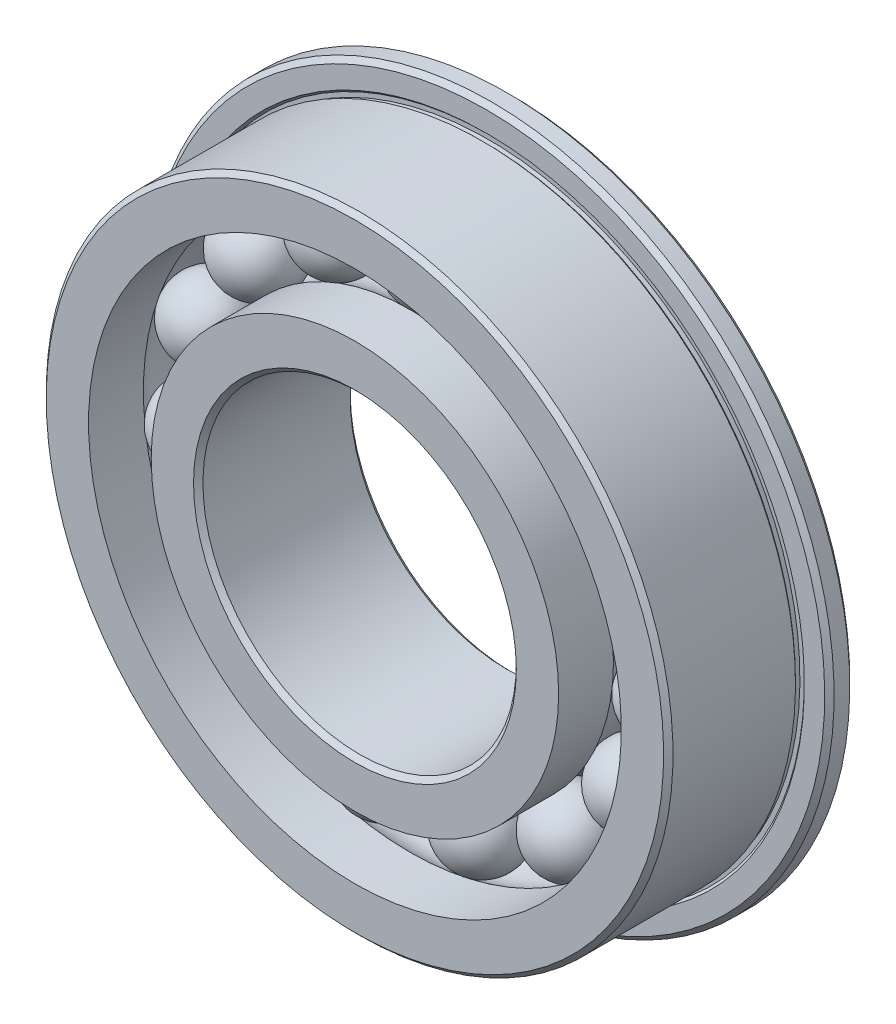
ISO-10303-21;
HEADER;
FILE_DESCRIPTION(('STEP AP214'),'2;1');
FILE_NAME('part.step','',(''),(''),'','','');
FILE_SCHEMA(('AUTOMOTIVE_DESIGN { 1 0 10303 214 1 1 1 1 }'));
ENDSEC;
DATA;
#1=APPLICATION_CONTEXT('core data for automotive mechanical design processes');
#2=APPLICATION_PROTOCOL_DEFINITION('international standard','automotive_design',2000,#1);
#3=PRODUCT_CONTEXT('',#1,'mechanical');
#4=PRODUCT('Part','Part','',(#3));
#5=PRODUCT_RELATED_PRODUCT_CATEGORY('part','',(#4));
#6=PRODUCT_DEFINITION_FORMATION('','',#4);
#7=PRODUCT_DEFINITION_CONTEXT('part definition',#1,'design');
#8=PRODUCT_DEFINITION('design','',#6,#7);
#9=PRODUCT_DEFINITION_SHAPE('','',#8);
#10=(LENGTH_UNIT() NAMED_UNIT(*) SI_UNIT(.MILLI.,.METRE.));
#11=(NAMED_UNIT(*) PLANE_ANGLE_UNIT() SI_UNIT($,.RADIAN.));
#12=(NAMED_UNIT(*) SI_UNIT($,.STERADIAN.) SOLID_ANGLE_UNIT());
#13=UNCERTAINTY_MEASURE_WITH_UNIT(LENGTH_MEASURE(1.E-05),#10,'distance_accuracy_value','');
#14=(GEOMETRIC_REPRESENTATION_CONTEXT(3) GLOBAL_UNCERTAINTY_ASSIGNED_CONTEXT((#13)) GLOBAL_UNIT_ASSIGNED_CONTEXT((#10,
#11,#12)) REPRESENTATION_CONTEXT('',''));
#15=CARTESIAN_POINT('',(0.,0.,0.));
#16=DIRECTION('',(0.,0.,1.));
#17=DIRECTION('',(1.,0.,0.));
#18=AXIS2_PLACEMENT_3D('',#15,#16,#17);
#19=CARTESIAN_POINT('',(-1.93708326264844,4.35076024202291,0.));
#20=DIRECTION('',(-0.406736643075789,0.913545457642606,0.));
#21=DIRECTION('',(0.913545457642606,0.406736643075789,0.));
#22=AXIS2_PLACEMENT_3D('',#19,#20,#21);
#23=SPHERICAL_SURFACE('',#22,0.79375);
#24=CARTESIAN_POINT('',(-2.25993047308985,5.07588694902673,0.));
#25=VERTEX_POINT('',#24);
#26=VERTEX_LOOP('',#25);
#27=FACE_BOUND('',#26,.T.);
#28=ADVANCED_FACE('F43',(#27),#23,.T.);
#29=CLOSED_SHELL('',(#28));
#30=MANIFOLD_SOLID_BREP('B2',#29);
#31=CARTESIAN_POINT('',(-3.53922723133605,3.1867345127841,0.));
#32=DIRECTION('',(-0.743144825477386,0.669130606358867,0.));
#33=DIRECTION('',(0.669130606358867,0.743144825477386,0.));
#34=AXIS2_PLACEMENT_3D('',#31,#32,#33);
#35=SPHERICAL_SURFACE('',#34,0.79375);
#36=CARTESIAN_POINT('',(-4.12909843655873,3.71785693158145,0.));
#37=VERTEX_POINT('',#36);
#38=VERTEX_LOOP('',#37);
#39=FACE_BOUND('',#38,.T.);
#40=ADVANCED_FACE('F61',(#39),#35,.T.);
#41=CLOSED_SHELL('',(#40));
#42=MANIFOLD_SOLID_BREP('B7',#41);
#43=CARTESIAN_POINT('',(-4.52940665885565,1.47169343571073,0.));
#44=DIRECTION('',(-0.95105651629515,0.309016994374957,0.));
#45=DIRECTION('',(0.309016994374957,0.95105651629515,0.));
#46=AXIS2_PLACEMENT_3D('',#43,#44,#45);
#47=SPHERICAL_SURFACE('',#46,0.79375);
#48=CARTESIAN_POINT('',(-5.28430776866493,1.71697567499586,0.));
#49=VERTEX_POINT('',#48);
#50=VERTEX_LOOP('',#49);
#51=FACE_BOUND('',#50,.T.);
#52=ADVANCED_FACE('F79',(#51),#47,.T.);
#53=CLOSED_SHELL('',(#52));
#54=MANIFOLD_SOLID_BREP('B39',#53);
#55=CARTESIAN_POINT('',(-4.73641052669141,-0.497816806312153,0.));
#56=DIRECTION('',(-0.994521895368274,-0.104528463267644,0.));
#57=DIRECTION('',(-0.104528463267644,0.994521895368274,0.));
#58=AXIS2_PLACEMENT_3D('',#55,#56,#57);
#59=SPHERICAL_SURFACE('',#58,0.79375);
#60=CARTESIAN_POINT('',(-5.52581228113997,-0.580786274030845,0.));
#61=VERTEX_POINT('',#60);
#62=VERTEX_LOOP('',#61);
#63=FACE_BOUND('',#62,.T.);
#64=ADVANCED_FACE('F97',(#63),#59,.T.);
#65=CLOSED_SHELL('',(#64));
#66=MANIFOLD_SOLID_BREP('B57',#65);
#67=CARTESIAN_POINT('',(-4.12444598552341,-2.38124999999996,0.));
#68=DIRECTION('',(-0.866025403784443,-0.499999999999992,0.));
#69=DIRECTION('',(-0.499999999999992,0.866025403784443,0.));
#70=AXIS2_PLACEMENT_3D('',#67,#68,#69);
#71=SPHERICAL_SURFACE('',#70,0.79375);
#72=CARTESIAN_POINT('',(-4.81185364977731,-2.77812499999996,0.));
#73=VERTEX_POINT('',#72);
#74=VERTEX_LOOP('',#73);
#75=FACE_BOUND('',#74,.T.);
#76=ADVANCED_FACE('F115',(#75),#71,.T.);
#77=CLOSED_SHELL('',(#76));
#78=MANIFOLD_SOLID_BREP('B75',#77);
#79=CARTESIAN_POINT('',(-2.79932726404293,-3.85294343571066,0.));
#80=DIRECTION('',(-0.58778525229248,-0.809016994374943,0.));
#81=DIRECTION('',(-0.809016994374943,0.58778525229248,0.));
#82=AXIS2_PLACEMENT_3D('',#79,#80,#81);
#83=SPHERICAL_SURFACE('',#82,0.79375);
#84=CARTESIAN_POINT('',(-3.26588180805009,-4.49510067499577,0.));
#85=VERTEX_POINT('',#84);
#86=VERTEX_LOOP('',#85);
#87=FACE_BOUND('',#86,.T.);
#88=ADVANCED_FACE('F133',(#87),#83,.T.);
#89=CLOSED_SHELL('',(#88));
#90=MANIFOLD_SOLID_BREP('B93',#89);
#91=CARTESIAN_POINT('',(-0.990179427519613,-4.65842794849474,0.));
#92=DIRECTION('',(-0.207911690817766,-0.978147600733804,0.));
#93=DIRECTION('',(-0.978147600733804,0.207911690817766,0.));
#94=AXIS2_PLACEMENT_3D('',#91,#92,#93);
#95=SPHERICAL_SURFACE('',#94,0.79375);
#96=CARTESIAN_POINT('',(-1.15520933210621,-5.4348326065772,0.));
#97=VERTEX_POINT('',#96);
#98=VERTEX_LOOP('',#97);
#99=FACE_BOUND('',#98,.T.);
#100=ADVANCED_FACE('F151',(#99),#95,.T.);
#101=CLOSED_SHELL('',(#100));
#102=MANIFOLD_SOLID_BREP('B111',#101);
#103=CARTESIAN_POINT('',(0.99017942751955,-4.65842794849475,0.));
#104=DIRECTION('',(0.207911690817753,-0.978147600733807,0.));
#105=DIRECTION('',(-0.978147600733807,-0.207911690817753,0.));
#106=AXIS2_PLACEMENT_3D('',#103,#104,#105);
#107=SPHERICAL_SURFACE('',#106,0.79375);
#108=CARTESIAN_POINT('',(1.15520933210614,-5.43483260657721,0.));
#109=VERTEX_POINT('',#108);
#110=VERTEX_LOOP('',#109);
#111=FACE_BOUND('',#110,.T.);
#112=ADVANCED_FACE('F169',(#111),#107,.T.);
#113=CLOSED_SHELL('',(#112));
#114=MANIFOLD_SOLID_BREP('B129',#113);
#115=CARTESIAN_POINT('',(2.79932726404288,-3.8529434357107,0.));
#116=DIRECTION('',(0.587785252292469,-0.80901699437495,0.));
#117=DIRECTION('',(-0.80901699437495,-0.587785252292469,0.));
#118=AXIS2_PLACEMENT_3D('',#115,#116,#117);
#119=SPHERICAL_SURFACE('',#118,0.79375);
#120=CARTESIAN_POINT('',(3.26588180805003,-4.49510067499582,0.));
#121=VERTEX_POINT('',#120);
#122=VERTEX_LOOP('',#121);
#123=FACE_BOUND('',#122,.T.);
#124=ADVANCED_FACE('F187',(#123),#119,.T.);
#125=CLOSED_SHELL('',(#124));
#126=MANIFOLD_SOLID_BREP('B147',#125);
#127=CARTESIAN_POINT('',(4.12444598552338,-2.38125000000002,0.));
#128=DIRECTION('',(0.866025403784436,-0.500000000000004,0.));
#129=DIRECTION('',(-0.500000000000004,-0.866025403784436,0.));
#130=AXIS2_PLACEMENT_3D('',#127,#128,#129);
#131=SPHERICAL_SURFACE('',#130,0.79375);
#132=CARTESIAN_POINT('',(4.81185364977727,-2.77812500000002,0.));
#133=VERTEX_POINT('',#132);
#134=VERTEX_LOOP('',#133);
#135=FACE_BOUND('',#134,.T.);
#136=ADVANCED_FACE('F205',(#135),#131,.T.);
#137=CLOSED_SHELL('',(#136));
#138=MANIFOLD_SOLID_BREP('B165',#137);
#139=CARTESIAN_POINT('',(4.7364105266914,-0.497816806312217,0.));
#140=DIRECTION('',(0.994521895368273,-0.104528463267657,0.));
#141=DIRECTION('',(-0.104528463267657,-0.994521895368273,0.));
#142=AXIS2_PLACEMENT_3D('',#139,#140,#141);
#143=SPHERICAL_SURFACE('',#142,0.79375);
#144=CARTESIAN_POINT('',(5.52581228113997,-0.58078627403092,0.));
#145=VERTEX_POINT('',#144);
#146=VERTEX_LOOP('',#145);
#147=FACE_BOUND('',#146,.T.);
#148=ADVANCED_FACE('F223',(#147),#143,.T.);
#149=CLOSED_SHELL('',(#148));
#150=MANIFOLD_SOLID_BREP('B183',#149);
#151=CARTESIAN_POINT('',(4.52940665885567,1.47169343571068,0.));
#152=DIRECTION('',(0.951056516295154,0.309016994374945,0.));
#153=DIRECTION('',(0.309016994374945,-0.951056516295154,0.));
#154=AXIS2_PLACEMENT_3D('',#151,#152,#153);
#155=SPHERICAL_SURFACE('',#154,0.79375);
#156=CARTESIAN_POINT('',(5.28430776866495,1.71697567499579,0.));
#157=VERTEX_POINT('',#156);
#158=VERTEX_LOOP('',#157);
#159=FACE_BOUND('',#158,.T.);
#160=ADVANCED_FACE('F241',(#159),#155,.T.);
#161=CLOSED_SHELL('',(#160));
#162=MANIFOLD_SOLID_BREP('B201',#161);
#163=CARTESIAN_POINT('',(3.5392272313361,3.18673451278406,0.));
#164=DIRECTION('',(0.743144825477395,0.669130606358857,0.));
#165=DIRECTION('',(0.669130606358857,-0.743144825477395,0.));
#166=AXIS2_PLACEMENT_3D('',#163,#164,#165);
#167=SPHERICAL_SURFACE('',#166,0.79375);
#168=CARTESIAN_POINT('',(4.12909843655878,3.7178569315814,0.));
#169=VERTEX_POINT('',#168);
#170=VERTEX_LOOP('',#169);
#171=FACE_BOUND('',#170,.T.);
#172=ADVANCED_FACE('F259',(#171),#167,.T.);
#173=CLOSED_SHELL('',(#172));
#174=MANIFOLD_SOLID_BREP('B219',#173);
#175=CARTESIAN_POINT('',(1.9370832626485,4.35076024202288,0.));
#176=DIRECTION('',(0.406736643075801,0.913545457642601,0.));
#177=DIRECTION('',(0.913545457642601,-0.406736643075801,0.));
#178=AXIS2_PLACEMENT_3D('',#175,#176,#177);
#179=SPHERICAL_SURFACE('',#178,0.79375);
#180=CARTESIAN_POINT('',(2.25993047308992,5.0758869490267,0.));
#181=VERTEX_POINT('',#180);
#182=VERTEX_LOOP('',#181);
#183=FACE_BOUND('',#182,.T.);
#184=ADVANCED_FACE('F277',(#183),#179,.T.);
#185=CLOSED_SHELL('',(#184));
#186=MANIFOLD_SOLID_BREP('B237',#185);
#187=CARTESIAN_POINT('',(0.,4.7625,0.));
#188=DIRECTION('',(0.,1.,0.));
#189=DIRECTION('',(1.,0.,0.));
#190=AXIS2_PLACEMENT_3D('',#187,#188,#189);
#191=SPHERICAL_SURFACE('',#190,0.79375);
#192=CARTESIAN_POINT('',(0.,5.55625,0.));
#193=VERTEX_POINT('',#192);
#194=VERTEX_LOOP('',#193);
#195=FACE_BOUND('',#194,.T.);
#196=ADVANCED_FACE('F298',(#195),#191,.T.);
#197=CLOSED_SHELL('',(#196));
#198=MANIFOLD_SOLID_BREP('B255',#197);
#199=CARTESIAN_POINT('',(0.,0.,0.));
#200=DIRECTION('',(0.,0.,1.));
#201=DIRECTION('',(0.,-1.,0.));
#202=AXIS2_PLACEMENT_3D('',#199,#200,#201);
#203=CYLINDRICAL_SURFACE('',#202,4.1275);
#204=CARTESIAN_POINT('',(0.,0.,-0.47625));
#205=DIRECTION('',(0.,0.,1.));
#206=DIRECTION('',(0.,-1.,0.));
#207=AXIS2_PLACEMENT_3D('',#204,#205,#206);
#208=CIRCLE('',#207,4.1275);
#209=CARTESIAN_POINT('',(0.,-4.1275,-0.47625));
#210=VERTEX_POINT('',#209);
#211=EDGE_CURVE('E339',#210,#210,#208,.T.);
#212=ORIENTED_EDGE('',*,*,#211,.F.);
#213=EDGE_LOOP('',(#212));
#214=FACE_BOUND('',#213,.T.);
#215=CARTESIAN_POINT('',(0.,0.,-1.5875));
#216=DIRECTION('',(0.,0.,1.));
#217=DIRECTION('',(0.,-1.,0.));
#218=AXIS2_PLACEMENT_3D('',#215,#216,#217);
#219=CIRCLE('',#218,4.1275);
#220=CARTESIAN_POINT('',(0.,-4.1275,-1.5875));
#221=VERTEX_POINT('',#220);
#222=EDGE_CURVE('E348',#221,#221,#219,.T.);
#223=ORIENTED_EDGE('',*,*,#222,.T.);
#224=EDGE_LOOP('',(#223));
#225=FACE_BOUND('',#224,.T.);
#226=ADVANCED_FACE('F319',(#214,#225),#203,.T.);
#227=CARTESIAN_POINT('',(0.,0.,0.));
#228=DIRECTION('',(0.,0.,1.));
#229=DIRECTION('',(0.,-1.,0.));
#230=AXIS2_PLACEMENT_3D('',#227,#228,#229);
#231=TOROIDAL_SURFACE('',#230,4.7625,0.79375);
#232=CARTESIAN_POINT('',(0.,0.,0.47625));
#233=DIRECTION('',(0.,0.,1.));
#234=DIRECTION('',(0.,-1.,0.));
#235=AXIS2_PLACEMENT_3D('',#232,#233,#234);
#236=CIRCLE('',#235,4.1275);
#237=CARTESIAN_POINT('',(0.,-4.1275,0.476249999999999));
#238=VERTEX_POINT('',#237);
#239=EDGE_CURVE('E342',#238,#238,#236,.T.);
#240=ORIENTED_EDGE('',*,*,#239,.F.);
#241=EDGE_LOOP('',(#240));
#242=FACE_BOUND('',#241,.T.);
#243=ORIENTED_EDGE('',*,*,#211,.T.);
#244=EDGE_LOOP('',(#243));
#245=FACE_BOUND('',#244,.T.);
#246=ADVANCED_FACE('F367',(#242,#245),#231,.F.);
#247=CARTESIAN_POINT('',(0.,0.,0.));
#248=DIRECTION('',(0.,0.,1.));
#249=DIRECTION('',(0.,-1.,0.));
#250=AXIS2_PLACEMENT_3D('',#247,#248,#249);
#251=CYLINDRICAL_SURFACE('',#250,4.1275);
#252=CARTESIAN_POINT('',(0.,0.,1.5875));
#253=DIRECTION('',(0.,0.,1.));
#254=DIRECTION('',(0.,-1.,0.));
#255=AXIS2_PLACEMENT_3D('',#252,#253,#254);
#256=CIRCLE('',#255,4.1275);
#257=CARTESIAN_POINT('',(0.,-4.1275,1.5875));
#258=VERTEX_POINT('',#257);
#259=EDGE_CURVE('E345',#258,#258,#256,.T.);
#260=ORIENTED_EDGE('',*,*,#259,.F.);
#261=EDGE_LOOP('',(#260));
#262=FACE_BOUND('',#261,.T.);
#263=ORIENTED_EDGE('',*,*,#239,.T.);
#264=EDGE_LOOP('',(#263));
#265=FACE_BOUND('',#264,.T.);
#266=ADVANCED_FACE('F373',(#262,#265),#251,.T.);
#267=CARTESIAN_POINT('',(0.,3.175,1.5875));
#268=DIRECTION('',(0.,0.,-1.));
#269=DIRECTION('',(0.,1.,0.));
#270=AXIS2_PLACEMENT_3D('',#267,#268,#269);
#271=PLANE('',#270);
#272=CARTESIAN_POINT('',(0.,0.,1.5875));
#273=DIRECTION('',(0.,0.,-1.));
#274=DIRECTION('',(0.,1.,0.));
#275=AXIS2_PLACEMENT_3D('',#272,#273,#274);
#276=CIRCLE('',#275,3.27025);
#277=CARTESIAN_POINT('',(0.,-3.27025,1.5875));
#278=VERTEX_POINT('',#277);
#279=EDGE_CURVE('E297',#278,#278,#276,.T.);
#280=ORIENTED_EDGE('',*,*,#279,.T.);
#281=EDGE_LOOP('',(#280));
#282=FACE_BOUND('',#281,.T.);
#283=ORIENTED_EDGE('',*,*,#259,.T.);
#284=EDGE_LOOP('',(#283));
#285=FACE_BOUND('',#284,.T.);
#286=ADVANCED_FACE('F364',(#282,#285),#271,.F.);
#287=CARTESIAN_POINT('',(0.,0.,0.));
#288=DIRECTION('',(0.,0.,1.));
#289=DIRECTION('',(0.,-1.,0.));
#290=AXIS2_PLACEMENT_3D('',#287,#288,#289);
#291=CYLINDRICAL_SURFACE('',#290,3.175);
#292=CARTESIAN_POINT('',(0.,0.,-1.49225));
#293=DIRECTION('',(0.,0.,1.));
#294=DIRECTION('',(0.,-1.,0.));
#295=AXIS2_PLACEMENT_3D('',#292,#293,#294);
#296=CIRCLE('',#295,3.175);
#297=CARTESIAN_POINT('',(0.,-3.175,-1.49225));
#298=VERTEX_POINT('',#297);
#299=EDGE_CURVE('E326',#298,#298,#296,.F.);
#300=CARTESIAN_POINT('',(0.,0.,1.49225));
#301=DIRECTION('',(0.,0.,-1.));
#302=DIRECTION('',(0.,1.,0.));
#303=AXIS2_PLACEMENT_3D('',#300,#301,#302);
#304=CIRCLE('',#303,3.175);
#305=CARTESIAN_POINT('',(0.,-3.175,1.49225));
#306=VERTEX_POINT('',#305);
#307=EDGE_CURVE('E330',#306,#306,#304,.F.);
#308=CARTESIAN_POINT('',(0.,-3.175,-1.49225));
#309=CARTESIAN_POINT('',(0.,-3.175,-1.46116145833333));
#310=CARTESIAN_POINT('',(0.,-3.175,-1.43007291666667));
#311=CARTESIAN_POINT('',(0.,-3.175,-1.36789583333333));
#312=CARTESIAN_POINT('',(0.,-3.175,-1.33680729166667));
#313=CARTESIAN_POINT('',(0.,-3.175,-1.27463020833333));
#314=CARTESIAN_POINT('',(0.,-3.175,-1.24354166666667));
#315=CARTESIAN_POINT('',(0.,-3.175,-1.18136458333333));
#316=CARTESIAN_POINT('',(0.,-3.175,-1.15027604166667));
#317=CARTESIAN_POINT('',(0.,-3.175,-1.08809895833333));
#318=CARTESIAN_POINT('',(0.,-3.175,-1.05701041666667));
#319=CARTESIAN_POINT('',(0.,-3.175,-0.994833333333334));
#320=CARTESIAN_POINT('',(0.,-3.175,-0.963744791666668));
#321=CARTESIAN_POINT('',(0.,-3.175,-0.901567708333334));
#322=CARTESIAN_POINT('',(0.,-3.175,-0.870479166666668));
#323=CARTESIAN_POINT('',(0.,-3.175,-0.808302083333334));
#324=CARTESIAN_POINT('',(0.,-3.175,-0.777213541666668));
#325=CARTESIAN_POINT('',(0.,-3.175,-0.715036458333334));
#326=CARTESIAN_POINT('',(0.,-3.175,-0.683947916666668));
#327=CARTESIAN_POINT('',(0.,-3.175,-0.621770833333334));
#328=CARTESIAN_POINT('',(0.,-3.175,-0.590682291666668));
#329=CARTESIAN_POINT('',(0.,-3.175,-0.528505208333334));
#330=CARTESIAN_POINT('',(0.,-3.175,-0.497416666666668));
#331=CARTESIAN_POINT('',(0.,-3.175,-0.435239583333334));
#332=CARTESIAN_POINT('',(0.,-3.175,-0.404151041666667));
#333=CARTESIAN_POINT('',(0.,-3.175,-0.341973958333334));
#334=CARTESIAN_POINT('',(0.,-3.175,-0.310885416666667));
#335=CARTESIAN_POINT('',(0.,-3.175,-0.248708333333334));
#336=CARTESIAN_POINT('',(0.,-3.175,-0.217619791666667));
#337=CARTESIAN_POINT('',(0.,-3.175,-0.155442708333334));
#338=CARTESIAN_POINT('',(0.,-3.175,-0.124354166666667));
#339=CARTESIAN_POINT('',(0.,-3.175,-0.062177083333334));
#340=CARTESIAN_POINT('',(0.,-3.175,-0.0310885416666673));
#341=CARTESIAN_POINT('',(0.,-3.175,0.0310885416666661));
#342=CARTESIAN_POINT('',(0.,-3.175,0.0621770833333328));
#343=CARTESIAN_POINT('',(0.,-3.175,0.124354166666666));
#344=CARTESIAN_POINT('',(0.,-3.175,0.155442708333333));
#345=CARTESIAN_POINT('',(0.,-3.175,0.217619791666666));
#346=CARTESIAN_POINT('',(0.,-3.175,0.248708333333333));
#347=CARTESIAN_POINT('',(0.,-3.175,0.310885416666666));
#348=CARTESIAN_POINT('',(0.,-3.175,0.341973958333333));
#349=CARTESIAN_POINT('',(0.,-3.175,0.404151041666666));
#350=CARTESIAN_POINT('',(0.,-3.175,0.435239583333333));
#351=CARTESIAN_POINT('',(0.,-3.175,0.497416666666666));
#352=CARTESIAN_POINT('',(0.,-3.175,0.528505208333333));
#353=CARTESIAN_POINT('',(0.,-3.175,0.590682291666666));
#354=CARTESIAN_POINT('',(0.,-3.175,0.621770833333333));
#355=CARTESIAN_POINT('',(0.,-3.175,0.683947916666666));
#356=CARTESIAN_POINT('',(0.,-3.175,0.715036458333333));
#357=CARTESIAN_POINT('',(0.,-3.175,0.777213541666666));
#358=CARTESIAN_POINT('',(0.,-3.175,0.808302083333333));
#359=CARTESIAN_POINT('',(0.,-3.175,0.870479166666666));
#360=CARTESIAN_POINT('',(0.,-3.175,0.901567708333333));
#361=CARTESIAN_POINT('',(0.,-3.175,0.963744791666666));
#362=CARTESIAN_POINT('',(0.,-3.175,0.994833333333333));
#363=CARTESIAN_POINT('',(0.,-3.175,1.05701041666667));
#364=CARTESIAN_POINT('',(0.,-3.175,1.08809895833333));
#365=CARTESIAN_POINT('',(0.,-3.175,1.15027604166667));
#366=CARTESIAN_POINT('',(0.,-3.175,1.18136458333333));
#367=CARTESIAN_POINT('',(0.,-3.175,1.24354166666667));
#368=CARTESIAN_POINT('',(0.,-3.175,1.27463020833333));
#369=CARTESIAN_POINT('',(0.,-3.175,1.33680729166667));
#370=CARTESIAN_POINT('',(0.,-3.175,1.36789583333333));
#371=CARTESIAN_POINT('',(0.,-3.175,1.43007291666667));
#372=CARTESIAN_POINT('',(0.,-3.175,1.46116145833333));
#373=CARTESIAN_POINT('',(0.,-3.175,1.49225));
#374=B_SPLINE_CURVE_WITH_KNOTS('',3,(#308,#309,#310,#311,#312,#313,#314,#315,#316,#317,#318,
#319,#320,#321,#322,#323,#324,#325,#326,#327,#328,#329,#330,#331,#332,#333,#334,#335,#336,#337,
#338,#339,#340,#341,#342,#343,#344,#345,#346,#347,#348,#349,#350,#351,#352,#353,#354,#355,#356,
#357,#358,#359,#360,#361,#362,#363,#364,#365,#366,#367,#368,#369,#370,#371,#372,#373),
.UNSPECIFIED.,.F.,.F.,(4,2,2,2,2,2,2,2,2,2,2,2,2,2,2,2,2,2,2,2,2,2,2,2,2,2,2,2,2,2,2,2,4),(0.,
0.093265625,0.18653125,0.279796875,0.3730625,0.466328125,0.55959375,0.652859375,0.746125,
0.839390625,0.93265625,1.025921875,1.1191875,1.212453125,1.30571875,1.398984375,1.49225,
1.585515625,1.67878125,1.772046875,1.8653125,1.958578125,2.05184375,2.145109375,2.238375,
2.331640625,2.42490625,2.518171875,2.6114375,2.704703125,2.79796875,2.891234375,2.9845),.UNSPECIFIED.);
#375=EDGE_CURVE('BSEAM356',#298,#306,#374,.T.);
#376=ORIENTED_EDGE('',*,*,#299,.T.);
#377=ORIENTED_EDGE('',*,*,#307,.T.);
#378=ORIENTED_EDGE('',*,*,#375,.T.);
#379=ORIENTED_EDGE('',*,*,#375,.F.);
#380=EDGE_LOOP('',(#376,#378,#377,#379));
#381=FACE_BOUND('',#380,.T.);
#382=ADVANCED_FACE('F356',(#381),#291,.F.);
#383=CARTESIAN_POINT('',(0.,4.1275,-1.5875));
#384=DIRECTION('',(0.,0.,1.));
#385=DIRECTION('',(0.,-1.,0.));
#386=AXIS2_PLACEMENT_3D('',#383,#384,#385);
#387=PLANE('',#386);
#388=CARTESIAN_POINT('',(0.,0.,-1.5875));
#389=DIRECTION('',(0.,0.,1.));
#390=DIRECTION('',(0.,-1.,0.));
#391=AXIS2_PLACEMENT_3D('',#388,#389,#390);
#392=CIRCLE('',#391,3.27025);
#393=CARTESIAN_POINT('',(0.,-3.27025,-1.5875));
#394=VERTEX_POINT('',#393);
#395=EDGE_CURVE('E334',#394,#394,#392,.T.);
#396=ORIENTED_EDGE('',*,*,#395,.T.);
#397=EDGE_LOOP('',(#396));
#398=FACE_BOUND('',#397,.T.);
#399=ORIENTED_EDGE('',*,*,#222,.F.);
#400=EDGE_LOOP('',(#399));
#401=FACE_BOUND('',#400,.T.);
#402=ADVANCED_FACE('F353',(#398,#401),#387,.F.);
#403=CARTESIAN_POINT('',(0.,0.,-1.5875));
#404=DIRECTION('',(0.,0.,-1.));
#405=DIRECTION('',(0.,1.,0.));
#406=AXIS2_PLACEMENT_3D('',#403,#404,#405);
#407=CONICAL_SURFACE('',#406,3.27025,0.785398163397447);
#408=ORIENTED_EDGE('',*,*,#299,.F.);
#409=EDGE_LOOP('',(#408));
#410=FACE_BOUND('',#409,.T.);
#411=ORIENTED_EDGE('',*,*,#395,.F.);
#412=EDGE_LOOP('',(#411));
#413=FACE_BOUND('',#412,.T.);
#414=ADVANCED_FACE('F355',(#410,#413),#407,.F.);
#415=CARTESIAN_POINT('',(0.,0.,1.49225));
#416=DIRECTION('',(0.,0.,1.));
#417=DIRECTION('',(0.,-1.,0.));
#418=AXIS2_PLACEMENT_3D('',#415,#416,#417);
#419=CONICAL_SURFACE('',#418,3.175,0.785398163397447);
#420=CARTESIAN_POINT('',(0.,-3.27025,1.5875));
#421=CARTESIAN_POINT('',(0.,-3.2692578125,1.5865078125));
#422=CARTESIAN_POINT('',(0.,-3.268265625,1.585515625));
#423=CARTESIAN_POINT('',(0.,-3.26628125,1.58353125));
#424=CARTESIAN_POINT('',(0.,-3.2652890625,1.5825390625));
#425=CARTESIAN_POINT('',(0.,-3.2633046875,1.5805546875));
#426=CARTESIAN_POINT('',(0.,-3.2623125,1.5795625));
#427=CARTESIAN_POINT('',(0.,-3.260328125,1.577578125));
#428=CARTESIAN_POINT('',(0.,-3.2593359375,1.5765859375));
#429=CARTESIAN_POINT('',(0.,-3.2573515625,1.5746015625));
#430=CARTESIAN_POINT('',(0.,-3.256359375,1.573609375));
#431=CARTESIAN_POINT('',(0.,-3.254375,1.571625));
#432=CARTESIAN_POINT('',(0.,-3.2533828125,1.5706328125));
#433=CARTESIAN_POINT('',(0.,-3.2513984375,1.5686484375));
#434=CARTESIAN_POINT('',(0.,-3.25040625,1.56765625));
#435=CARTESIAN_POINT('',(0.,-3.248421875,1.565671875));
#436=CARTESIAN_POINT('',(0.,-3.2474296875,1.5646796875));
#437=CARTESIAN_POINT('',(0.,-3.2454453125,1.5626953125));
#438=CARTESIAN_POINT('',(0.,-3.244453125,1.561703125));
#439=CARTESIAN_POINT('',(0.,-3.24246875,1.55971875));
#440=CARTESIAN_POINT('',(0.,-3.2414765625,1.5587265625));
#441=CARTESIAN_POINT('',(0.,-3.2394921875,1.5567421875));
#442=CARTESIAN_POINT('',(0.,-3.2385,1.55575));
#443=CARTESIAN_POINT('',(0.,-3.236515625,1.553765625));
#444=CARTESIAN_POINT('',(0.,-3.2355234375,1.5527734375));
#445=CARTESIAN_POINT('',(0.,-3.2335390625,1.5507890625));
#446=CARTESIAN_POINT('',(0.,-3.232546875,1.549796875));
#447=CARTESIAN_POINT('',(0.,-3.2305625,1.5478125));
#448=CARTESIAN_POINT('',(0.,-3.2295703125,1.5468203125));
#449=CARTESIAN_POINT('',(0.,-3.2275859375,1.5448359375));
#450=CARTESIAN_POINT('',(0.,-3.22659375,1.54384375));
#451=CARTESIAN_POINT('',(0.,-3.224609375,1.541859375));
#452=CARTESIAN_POINT('',(0.,-3.2236171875,1.5408671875));
#453=CARTESIAN_POINT('',(0.,-3.2216328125,1.5388828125));
#454=CARTESIAN_POINT('',(0.,-3.220640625,1.537890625));
#455=CARTESIAN_POINT('',(0.,-3.21865625,1.53590625));
#456=CARTESIAN_POINT('',(0.,-3.2176640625,1.5349140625));
#457=CARTESIAN_POINT('',(0.,-3.2156796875,1.5329296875));
#458=CARTESIAN_POINT('',(0.,-3.2146875,1.5319375));
#459=CARTESIAN_POINT('',(0.,-3.212703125,1.529953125));
#460=CARTESIAN_POINT('',(0.,-3.2117109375,1.5289609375));
#461=CARTESIAN_POINT('',(0.,-3.2097265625,1.5269765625));
#462=CARTESIAN_POINT('',(0.,-3.208734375,1.525984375));
#463=CARTESIAN_POINT('',(0.,-3.20675,1.524));
#464=CARTESIAN_POINT('',(0.,-3.2057578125,1.5230078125));
#465=CARTESIAN_POINT('',(0.,-3.2037734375,1.5210234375));
#466=CARTESIAN_POINT('',(0.,-3.20278125,1.52003125));
#467=CARTESIAN_POINT('',(0.,-3.200796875,1.518046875));
#468=CARTESIAN_POINT('',(0.,-3.1998046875,1.5170546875));
#469=CARTESIAN_POINT('',(0.,-3.1978203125,1.5150703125));
#470=CARTESIAN_POINT('',(0.,-3.196828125,1.514078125));
#471=CARTESIAN_POINT('',(0.,-3.19484375,1.51209375));
#472=CARTESIAN_POINT('',(0.,-3.1938515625,1.5111015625));
#473=CARTESIAN_POINT('',(0.,-3.1918671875,1.5091171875));
#474=CARTESIAN_POINT('',(0.,-3.190875,1.508125));
#475=CARTESIAN_POINT('',(0.,-3.188890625,1.506140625));
#476=CARTESIAN_POINT('',(0.,-3.1878984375,1.5051484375));
#477=CARTESIAN_POINT('',(0.,-3.1859140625,1.5031640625));
#478=CARTESIAN_POINT('',(0.,-3.184921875,1.502171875));
#479=CARTESIAN_POINT('',(0.,-3.1829375,1.5001875));
#480=CARTESIAN_POINT('',(0.,-3.1819453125,1.4991953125));
#481=CARTESIAN_POINT('',(0.,-3.1799609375,1.4972109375));
#482=CARTESIAN_POINT('',(0.,-3.17896875,1.49621875));
#483=CARTESIAN_POINT('',(0.,-3.176984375,1.494234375));
#484=CARTESIAN_POINT('',(0.,-3.1759921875,1.4932421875));
#485=CARTESIAN_POINT('',(0.,-3.175,1.49225));
#486=B_SPLINE_CURVE_WITH_KNOTS('',3,(#420,#421,#422,#423,#424,#425,#426,#427,#428,#429,#430,
#431,#432,#433,#434,#435,#436,#437,#438,#439,#440,#441,#442,#443,#444,#445,#446,#447,#448,#449,
#450,#451,#452,#453,#454,#455,#456,#457,#458,#459,#460,#461,#462,#463,#464,#465,#466,#467,#468,
#469,#470,#471,#472,#473,#474,#475,#476,#477,#478,#479,#480,#481,#482,#483,#484,#485),
.UNSPECIFIED.,.F.,.F.,(4,2,2,2,2,2,2,2,2,2,2,2,2,2,2,2,2,2,2,2,2,2,2,2,2,2,2,2,2,2,2,2,4),(0.,
0.00420949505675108,0.00841899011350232,0.0126284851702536,0.0168379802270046,
0.0210474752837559,0.0252569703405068,0.029466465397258,0.0336759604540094,0.0378854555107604,
0.0420949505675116,0.046304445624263,0.0505139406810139,0.0547234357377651,0.0589329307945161,
0.0631424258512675,0.0673519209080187,0.0715614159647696,0.075770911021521,0.0799804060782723,
0.0841899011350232,0.0883993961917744,0.0926088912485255,0.0968183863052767,0.101027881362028,
0.105237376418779,0.10944687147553,0.113656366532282,0.117865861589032,0.122075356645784,
0.126284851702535,0.130494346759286,0.134703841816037),.UNSPECIFIED.);
#487=EDGE_CURVE('BSEAM321',#278,#306,#486,.T.);
#488=ORIENTED_EDGE('',*,*,#279,.F.);
#489=ORIENTED_EDGE('',*,*,#307,.F.);
#490=ORIENTED_EDGE('',*,*,#487,.T.);
#491=ORIENTED_EDGE('',*,*,#487,.F.);
#492=EDGE_LOOP('',(#488,#490,#489,#491));
#493=FACE_BOUND('',#492,.T.);
#494=ADVANCED_FACE('F321',(#493),#419,.F.);
#495=CLOSED_SHELL('',(#226,#246,#266,#286,#382,#402,#414,#494));
#496=MANIFOLD_SOLID_BREP('B273',#495);
#497=CARTESIAN_POINT('',(0.,5.3975,-1.5875));
#498=DIRECTION('',(0.,0.,1.));
#499=DIRECTION('',(0.,-1.,0.));
#500=AXIS2_PLACEMENT_3D('',#497,#498,#499);
#501=PLANE('',#500);
#502=CARTESIAN_POINT('',(0.,0.,-1.5875));
#503=DIRECTION('',(0.,0.,1.));
#504=DIRECTION('',(0.,-1.,0.));
#505=AXIS2_PLACEMENT_3D('',#502,#503,#504);
#506=CIRCLE('',#505,6.85165);
#507=CARTESIAN_POINT('',(0.,-6.85165,-1.5875));
#508=VERTEX_POINT('',#507);
#509=EDGE_CURVE('E456',#508,#508,#506,.F.);
#510=ORIENTED_EDGE('',*,*,#509,.T.);
#511=EDGE_LOOP('',(#510));
#512=FACE_BOUND('',#511,.T.);
#513=CARTESIAN_POINT('',(0.,0.,-1.5875));
#514=DIRECTION('',(0.,0.,1.));
#515=DIRECTION('',(0.,-1.,0.));
#516=AXIS2_PLACEMENT_3D('',#513,#514,#515);
#517=CIRCLE('',#516,5.3975);
#518=CARTESIAN_POINT('',(0.,-5.3975,-1.5875));
#519=VERTEX_POINT('',#518);
#520=EDGE_CURVE('E467',#519,#519,#517,.T.);
#521=ORIENTED_EDGE('',*,*,#520,.T.);
#522=EDGE_LOOP('',(#521));
#523=FACE_BOUND('',#522,.T.);
#524=ADVANCED_FACE('F441',(#512,#523),#501,.F.);
#525=CARTESIAN_POINT('',(0.,0.,0.));
#526=DIRECTION('',(0.,0.,1.));
#527=DIRECTION('',(0.,-1.,0.));
#528=AXIS2_PLACEMENT_3D('',#525,#526,#527);
#529=CYLINDRICAL_SURFACE('',#528,5.3975);
#530=ORIENTED_EDGE('',*,*,#520,.F.);
#531=EDGE_LOOP('',(#530));
#532=FACE_BOUND('',#531,.T.);
#533=CARTESIAN_POINT('',(0.,0.,-0.47625));
#534=DIRECTION('',(0.,0.,1.));
#535=DIRECTION('',(0.,-1.,0.));
#536=AXIS2_PLACEMENT_3D('',#533,#534,#535);
#537=CIRCLE('',#536,5.3975);
#538=CARTESIAN_POINT('',(0.,-5.3975,-0.47625));
#539=VERTEX_POINT('',#538);
#540=EDGE_CURVE('E470',#539,#539,#537,.T.);
#541=ORIENTED_EDGE('',*,*,#540,.T.);
#542=EDGE_LOOP('',(#541));
#543=FACE_BOUND('',#542,.T.);
#544=ADVANCED_FACE('F513',(#532,#543),#529,.F.);
#545=CARTESIAN_POINT('',(0.,0.,0.));
#546=DIRECTION('',(0.,0.,1.));
#547=DIRECTION('',(0.,-1.,0.));
#548=AXIS2_PLACEMENT_3D('',#545,#546,#547);
#549=TOROIDAL_SURFACE('',#548,4.7625,0.79375);
#550=ORIENTED_EDGE('',*,*,#540,.F.);
#551=EDGE_LOOP('',(#550));
#552=FACE_BOUND('',#551,.T.);
#553=CARTESIAN_POINT('',(0.,0.,0.47625));
#554=DIRECTION('',(0.,0.,1.));
#555=DIRECTION('',(0.,-1.,0.));
#556=AXIS2_PLACEMENT_3D('',#553,#554,#555);
#557=CIRCLE('',#556,5.3975);
#558=CARTESIAN_POINT('',(0.,-5.3975,0.476249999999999));
#559=VERTEX_POINT('',#558);
#560=EDGE_CURVE('E473',#559,#559,#557,.T.);
#561=ORIENTED_EDGE('',*,*,#560,.T.);
#562=EDGE_LOOP('',(#561));
#563=FACE_BOUND('',#562,.T.);
#564=ADVANCED_FACE('F519',(#552,#563),#549,.F.);
#565=CARTESIAN_POINT('',(0.,0.,0.));
#566=DIRECTION('',(0.,0.,1.));
#567=DIRECTION('',(0.,-1.,0.));
#568=AXIS2_PLACEMENT_3D('',#565,#566,#567);
#569=CYLINDRICAL_SURFACE('',#568,5.3975);
#570=ORIENTED_EDGE('',*,*,#560,.F.);
#571=EDGE_LOOP('',(#570));
#572=FACE_BOUND('',#571,.T.);
#573=CARTESIAN_POINT('',(0.,0.,1.5875));
#574=DIRECTION('',(0.,0.,1.));
#575=DIRECTION('',(0.,-1.,0.));
#576=AXIS2_PLACEMENT_3D('',#573,#574,#575);
#577=CIRCLE('',#576,5.3975);
#578=CARTESIAN_POINT('',(0.,-5.3975,1.5875));
#579=VERTEX_POINT('',#578);
#580=EDGE_CURVE('E476',#579,#579,#577,.T.);
#581=ORIENTED_EDGE('',*,*,#580,.T.);
#582=EDGE_LOOP('',(#581));
#583=FACE_BOUND('',#582,.T.);
#584=ADVANCED_FACE('F583',(#572,#583),#569,.F.);
#585=CARTESIAN_POINT('',(0.,6.35,1.5875));
#586=DIRECTION('',(0.,0.,-1.));
#587=DIRECTION('',(0.,1.,0.));
#588=AXIS2_PLACEMENT_3D('',#585,#586,#587);
#589=PLANE('',#588);
#590=CARTESIAN_POINT('',(0.,0.,1.5875));
#591=DIRECTION('',(0.,0.,-1.));
#592=DIRECTION('',(0.,1.,0.));
#593=AXIS2_PLACEMENT_3D('',#590,#591,#592);
#594=CIRCLE('',#593,6.25475);
#595=CARTESIAN_POINT('',(0.,6.25475,1.5875));
#596=VERTEX_POINT('',#595);
#597=EDGE_CURVE('E448',#596,#596,#594,.F.);
#598=ORIENTED_EDGE('',*,*,#597,.T.);
#599=EDGE_LOOP('',(#598));
#600=FACE_BOUND('',#599,.T.);
#601=ORIENTED_EDGE('',*,*,#580,.F.);
#602=EDGE_LOOP('',(#601));
#603=FACE_BOUND('',#602,.T.);
#604=ADVANCED_FACE('F573',(#600,#603),#589,.F.);
#605=CARTESIAN_POINT('',(0.,0.,0.));
#606=DIRECTION('',(0.,0.,1.));
#607=DIRECTION('',(0.,-1.,0.));
#608=AXIS2_PLACEMENT_3D('',#605,#606,#607);
#609=CYLINDRICAL_SURFACE('',#608,6.35);
#610=CARTESIAN_POINT('',(0.,0.,1.49225));
#611=DIRECTION('',(0.,0.,-1.));
#612=DIRECTION('',(0.,1.,0.));
#613=AXIS2_PLACEMENT_3D('',#610,#611,#612);
#614=CIRCLE('',#613,6.35);
#615=CARTESIAN_POINT('',(0.,6.35,1.49225));
#616=VERTEX_POINT('',#615);
#617=EDGE_CURVE('E318',#616,#616,#614,.T.);
#618=ORIENTED_EDGE('',*,*,#617,.T.);
#619=EDGE_LOOP('',(#618));
#620=FACE_BOUND('',#619,.T.);
#621=CARTESIAN_POINT('',(0.,0.,-0.989697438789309));
#622=DIRECTION('',(0.,0.,1.));
#623=DIRECTION('',(0.,-1.,0.));
#624=AXIS2_PLACEMENT_3D('',#621,#622,#623);
#625=CIRCLE('',#624,6.35);
#626=CARTESIAN_POINT('',(0.,-6.35,-0.98969743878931));
#627=VERTEX_POINT('',#626);
#628=EDGE_CURVE('E479',#627,#627,#625,.T.);
#629=ORIENTED_EDGE('',*,*,#628,.T.);
#630=EDGE_LOOP('',(#629));
#631=FACE_BOUND('',#630,.T.);
#632=ADVANCED_FACE('F567',(#620,#631),#609,.T.);
#633=CARTESIAN_POINT('',(0.,0.,-1.03459871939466));
#634=DIRECTION('',(0.,0.,1.));
#635=DIRECTION('',(0.,-1.,0.));
#636=AXIS2_PLACEMENT_3D('',#633,#634,#635);
#637=CONICAL_SURFACE('',#636,6.30509871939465,0.785398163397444);
#638=ORIENTED_EDGE('',*,*,#628,.F.);
#639=EDGE_LOOP('',(#638));
#640=FACE_BOUND('',#639,.T.);
#641=CARTESIAN_POINT('',(0.,0.,-1.03459871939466));
#642=DIRECTION('',(0.,0.,1.));
#643=DIRECTION('',(0.,-1.,0.));
#644=AXIS2_PLACEMENT_3D('',#641,#642,#643);
#645=CIRCLE('',#644,6.30509871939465);
#646=CARTESIAN_POINT('',(0.,-6.30509871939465,-1.03459871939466));
#647=VERTEX_POINT('',#646);
#648=EDGE_CURVE('E482',#647,#647,#645,.T.);
#649=ORIENTED_EDGE('',*,*,#648,.T.);
#650=EDGE_LOOP('',(#649));
#651=FACE_BOUND('',#650,.T.);
#652=ADVANCED_FACE('F572',(#640,#651),#637,.T.);
#653=CARTESIAN_POINT('',(0.,0.,0.));
#654=DIRECTION('',(0.,0.,1.));
#655=DIRECTION('',(0.,-1.,0.));
#656=AXIS2_PLACEMENT_3D('',#653,#654,#655);
#657=CYLINDRICAL_SURFACE('',#656,6.30509871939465);
#658=ORIENTED_EDGE('',*,*,#648,.F.);
#659=EDGE_LOOP('',(#658));
#660=FACE_BOUND('',#659,.T.);
#661=CARTESIAN_POINT('',(0.,0.,-1.12440128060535));
#662=DIRECTION('',(0.,0.,1.));
#663=DIRECTION('',(0.,-1.,0.));
#664=AXIS2_PLACEMENT_3D('',#661,#662,#663);
#665=CIRCLE('',#664,6.30509871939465);
#666=CARTESIAN_POINT('',(0.,-6.30509871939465,-1.12440128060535));
#667=VERTEX_POINT('',#666);
#668=EDGE_CURVE('E485',#667,#667,#665,.T.);
#669=ORIENTED_EDGE('',*,*,#668,.T.);
#670=EDGE_LOOP('',(#669));
#671=FACE_BOUND('',#670,.T.);
#672=ADVANCED_FACE('F605',(#660,#671),#657,.T.);
#673=CARTESIAN_POINT('',(0.,6.39490128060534,-1.12440128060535));
#674=DIRECTION('',(0.,0.,-1.));
#675=DIRECTION('',(0.,1.,0.));
#676=AXIS2_PLACEMENT_3D('',#673,#674,#675);
#677=PLANE('',#676);
#678=ORIENTED_EDGE('',*,*,#668,.F.);
#679=EDGE_LOOP('',(#678));
#680=FACE_BOUND('',#679,.T.);
#681=CARTESIAN_POINT('',(0.,0.,-1.12440128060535));
#682=DIRECTION('',(0.,0.,1.));
#683=DIRECTION('',(0.,-1.,0.));
#684=AXIS2_PLACEMENT_3D('',#681,#682,#683);
#685=CIRCLE('',#684,6.39490128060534);
#686=CARTESIAN_POINT('',(0.,-6.39490128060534,-1.12440128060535));
#687=VERTEX_POINT('',#686);
#688=EDGE_CURVE('E488',#687,#687,#685,.T.);
#689=ORIENTED_EDGE('',*,*,#688,.T.);
#690=EDGE_LOOP('',(#689));
#691=FACE_BOUND('',#690,.T.);
#692=ADVANCED_FACE('F509',(#680,#691),#677,.F.);
#693=CARTESIAN_POINT('',(0.,0.,-1.0795));
#694=DIRECTION('',(0.,0.,1.));
#695=DIRECTION('',(0.,-1.,0.));
#696=AXIS2_PLACEMENT_3D('',#693,#694,#695);
#697=CONICAL_SURFACE('',#696,6.43980256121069,0.785398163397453);
#698=ORIENTED_EDGE('',*,*,#688,.F.);
#699=EDGE_LOOP('',(#698));
#700=FACE_BOUND('',#699,.T.);
#701=CARTESIAN_POINT('',(0.,0.,-1.0795));
#702=DIRECTION('',(0.,0.,1.));
#703=DIRECTION('',(0.,-1.,0.));
#704=AXIS2_PLACEMENT_3D('',#701,#702,#703);
#705=CIRCLE('',#704,6.43980256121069);
#706=CARTESIAN_POINT('',(0.,-6.43980256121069,-1.0795));
#707=VERTEX_POINT('',#706);
#708=EDGE_CURVE('E491',#707,#707,#705,.T.);
#709=ORIENTED_EDGE('',*,*,#708,.T.);
#710=EDGE_LOOP('',(#709));
#711=FACE_BOUND('',#710,.T.);
#712=ADVANCED_FACE('F495',(#700,#711),#697,.F.);
#713=CARTESIAN_POINT('',(0.,6.9469,-1.0795));
#714=DIRECTION('',(0.,0.,-1.));
#715=DIRECTION('',(0.,1.,0.));
#716=AXIS2_PLACEMENT_3D('',#713,#714,#715);
#717=PLANE('',#716);
#718=CARTESIAN_POINT('',(0.,0.,-1.0795));
#719=DIRECTION('',(0.,0.,-1.));
#720=DIRECTION('',(0.,1.,0.));
#721=AXIS2_PLACEMENT_3D('',#718,#719,#720);
#722=CIRCLE('',#721,6.85165);
#723=CARTESIAN_POINT('',(0.,6.85165,-1.0795));
#724=VERTEX_POINT('',#723);
#725=EDGE_CURVE('E452',#724,#724,#722,.F.);
#726=ORIENTED_EDGE('',*,*,#725,.T.);
#727=EDGE_LOOP('',(#726));
#728=FACE_BOUND('',#727,.T.);
#729=ORIENTED_EDGE('',*,*,#708,.F.);
#730=EDGE_LOOP('',(#729));
#731=FACE_BOUND('',#730,.T.);
#732=ADVANCED_FACE('F497',(#728,#731),#717,.F.);
#733=CARTESIAN_POINT('',(0.,0.,0.));
#734=DIRECTION('',(0.,0.,1.));
#735=DIRECTION('',(0.,-1.,0.));
#736=AXIS2_PLACEMENT_3D('',#733,#734,#735);
#737=CYLINDRICAL_SURFACE('',#736,6.9469);
#738=CARTESIAN_POINT('',(0.,0.,-1.49225));
#739=DIRECTION('',(0.,0.,1.));
#740=DIRECTION('',(0.,-1.,0.));
#741=AXIS2_PLACEMENT_3D('',#738,#739,#740);
#742=CIRCLE('',#741,6.9469);
#743=CARTESIAN_POINT('',(0.,-6.9469,-1.49225));
#744=VERTEX_POINT('',#743);
#745=EDGE_CURVE('E461',#744,#744,#742,.T.);
#746=CARTESIAN_POINT('',(0.,0.,-1.17475));
#747=DIRECTION('',(0.,0.,-1.));
#748=DIRECTION('',(0.,1.,0.));
#749=AXIS2_PLACEMENT_3D('',#746,#747,#748);
#750=CIRCLE('',#749,6.9469);
#751=CARTESIAN_POINT('',(0.,-6.9469,-1.17475));
#752=VERTEX_POINT('',#751);
#753=EDGE_CURVE('E464',#752,#752,#750,.T.);
#754=CARTESIAN_POINT('',(0.,-6.9469,-1.49225));
#755=CARTESIAN_POINT('',(0.,-6.9469,-1.48894270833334));
#756=CARTESIAN_POINT('',(0.,-6.9469,-1.48563541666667));
#757=CARTESIAN_POINT('',(0.,-6.9469,-1.47902083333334));
#758=CARTESIAN_POINT('',(0.,-6.9469,-1.47571354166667));
#759=CARTESIAN_POINT('',(0.,-6.9469,-1.46909895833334));
#760=CARTESIAN_POINT('',(0.,-6.9469,-1.46579166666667));
#761=CARTESIAN_POINT('',(0.,-6.9469,-1.45917708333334));
#762=CARTESIAN_POINT('',(0.,-6.9469,-1.45586979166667));
#763=CARTESIAN_POINT('',(0.,-6.9469,-1.44925520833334));
#764=CARTESIAN_POINT('',(0.,-6.9469,-1.44594791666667));
#765=CARTESIAN_POINT('',(0.,-6.9469,-1.43933333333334));
#766=CARTESIAN_POINT('',(0.,-6.9469,-1.43602604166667));
#767=CARTESIAN_POINT('',(0.,-6.9469,-1.42941145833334));
#768=CARTESIAN_POINT('',(0.,-6.9469,-1.42610416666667));
#769=CARTESIAN_POINT('',(0.,-6.9469,-1.41948958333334));
#770=CARTESIAN_POINT('',(0.,-6.9469,-1.41618229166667));
#771=CARTESIAN_POINT('',(0.,-6.9469,-1.40956770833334));
#772=CARTESIAN_POINT('',(0.,-6.9469,-1.40626041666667));
#773=CARTESIAN_POINT('',(0.,-6.9469,-1.39964583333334));
#774=CARTESIAN_POINT('',(0.,-6.9469,-1.39633854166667));
#775=CARTESIAN_POINT('',(0.,-6.9469,-1.38972395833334));
#776=CARTESIAN_POINT('',(0.,-6.9469,-1.38641666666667));
#777=CARTESIAN_POINT('',(0.,-6.9469,-1.37980208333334));
#778=CARTESIAN_POINT('',(0.,-6.9469,-1.37649479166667));
#779=CARTESIAN_POINT('',(0.,-6.9469,-1.36988020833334));
#780=CARTESIAN_POINT('',(0.,-6.9469,-1.36657291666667));
#781=CARTESIAN_POINT('',(0.,-6.9469,-1.35995833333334));
#782=CARTESIAN_POINT('',(0.,-6.9469,-1.35665104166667));
#783=CARTESIAN_POINT('',(0.,-6.9469,-1.35003645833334));
#784=CARTESIAN_POINT('',(0.,-6.9469,-1.34672916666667));
#785=CARTESIAN_POINT('',(0.,-6.9469,-1.34011458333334));
#786=CARTESIAN_POINT('',(0.,-6.9469,-1.33680729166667));
#787=CARTESIAN_POINT('',(0.,-6.9469,-1.33019270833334));
#788=CARTESIAN_POINT('',(0.,-6.9469,-1.32688541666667));
#789=CARTESIAN_POINT('',(0.,-6.9469,-1.32027083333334));
#790=CARTESIAN_POINT('',(0.,-6.9469,-1.31696354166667));
#791=CARTESIAN_POINT('',(0.,-6.9469,-1.31034895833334));
#792=CARTESIAN_POINT('',(0.,-6.9469,-1.30704166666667));
#793=CARTESIAN_POINT('',(0.,-6.9469,-1.30042708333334));
#794=CARTESIAN_POINT('',(0.,-6.9469,-1.29711979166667));
#795=CARTESIAN_POINT('',(0.,-6.9469,-1.29050520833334));
#796=CARTESIAN_POINT('',(0.,-6.9469,-1.28719791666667));
#797=CARTESIAN_POINT('',(0.,-6.9469,-1.28058333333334));
#798=CARTESIAN_POINT('',(0.,-6.9469,-1.27727604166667));
#799=CARTESIAN_POINT('',(0.,-6.9469,-1.27066145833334));
#800=CARTESIAN_POINT('',(0.,-6.9469,-1.26735416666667));
#801=CARTESIAN_POINT('',(0.,-6.9469,-1.26073958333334));
#802=CARTESIAN_POINT('',(0.,-6.9469,-1.25743229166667));
#803=CARTESIAN_POINT('',(0.,-6.9469,-1.25081770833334));
#804=CARTESIAN_POINT('',(0.,-6.9469,-1.24751041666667));
#805=CARTESIAN_POINT('',(0.,-6.9469,-1.24089583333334));
#806=CARTESIAN_POINT('',(0.,-6.9469,-1.23758854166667));
#807=CARTESIAN_POINT('',(0.,-6.9469,-1.23097395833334));
#808=CARTESIAN_POINT('',(0.,-6.9469,-1.22766666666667));
#809=CARTESIAN_POINT('',(0.,-6.9469,-1.22105208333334));
#810=CARTESIAN_POINT('',(0.,-6.9469,-1.21774479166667));
#811=CARTESIAN_POINT('',(0.,-6.9469,-1.21113020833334));
#812=CARTESIAN_POINT('',(0.,-6.9469,-1.20782291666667));
#813=CARTESIAN_POINT('',(0.,-6.9469,-1.20120833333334));
#814=CARTESIAN_POINT('',(0.,-6.9469,-1.19790104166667));
#815=CARTESIAN_POINT('',(0.,-6.9469,-1.19128645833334));
#816=CARTESIAN_POINT('',(0.,-6.9469,-1.18797916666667));
#817=CARTESIAN_POINT('',(0.,-6.9469,-1.18136458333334));
#818=CARTESIAN_POINT('',(0.,-6.9469,-1.17805729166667));
#819=CARTESIAN_POINT('',(0.,-6.9469,-1.17475));
#820=B_SPLINE_CURVE_WITH_KNOTS('',3,(#754,#755,#756,#757,#758,#759,#760,#761,#762,#763,#764,
#765,#766,#767,#768,#769,#770,#771,#772,#773,#774,#775,#776,#777,#778,#779,#780,#781,#782,#783,
#784,#785,#786,#787,#788,#789,#790,#791,#792,#793,#794,#795,#796,#797,#798,#799,#800,#801,#802,
#803,#804,#805,#806,#807,#808,#809,#810,#811,#812,#813,#814,#815,#816,#817,#818,#819),
.UNSPECIFIED.,.F.,.F.,(4,2,2,2,2,2,2,2,2,2,2,2,2,2,2,2,2,2,2,2,2,2,2,2,2,2,2,2,2,2,2,2,4),(0.,
0.00992187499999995,0.0198437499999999,0.0297656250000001,0.0396875,0.049609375,
0.0595312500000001,0.0694531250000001,0.079375,0.089296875,0.0992187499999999,0.109140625,
0.1190625,0.128984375,0.13890625,0.148828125,0.15875,0.168671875,0.17859375,0.188515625,
0.1984375,0.208359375,0.21828125,0.228203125,0.238125,0.248046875,0.25796875,0.267890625,
0.2778125,0.287734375,0.29765625,0.307578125,0.3175),.UNSPECIFIED.);
#821=EDGE_CURVE('BSEAM499',#744,#752,#820,.T.);
#822=ORIENTED_EDGE('',*,*,#745,.T.);
#823=ORIENTED_EDGE('',*,*,#753,.T.);
#824=ORIENTED_EDGE('',*,*,#821,.T.);
#825=ORIENTED_EDGE('',*,*,#821,.F.);
#826=EDGE_LOOP('',(#822,#824,#823,#825));
#827=FACE_BOUND('',#826,.T.);
#828=ADVANCED_FACE('F499',(#827),#737,.T.);
#829=CARTESIAN_POINT('',(0.,0.,-1.49225));
#830=DIRECTION('',(0.,0.,1.));
#831=DIRECTION('',(0.,-1.,0.));
#832=AXIS2_PLACEMENT_3D('',#829,#830,#831);
#833=CONICAL_SURFACE('',#832,6.9469,0.785398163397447);
#834=CARTESIAN_POINT('',(0.,-6.85165,-1.5875));
#835=CARTESIAN_POINT('',(0.,-6.8526421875,-1.5865078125));
#836=CARTESIAN_POINT('',(0.,-6.853634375,-1.585515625));
#837=CARTESIAN_POINT('',(0.,-6.85561875,-1.58353125));
#838=CARTESIAN_POINT('',(0.,-6.8566109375,-1.5825390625));
#839=CARTESIAN_POINT('',(0.,-6.8585953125,-1.5805546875));
#840=CARTESIAN_POINT('',(0.,-6.8595875,-1.5795625));
#841=CARTESIAN_POINT('',(0.,-6.861571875,-1.577578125));
#842=CARTESIAN_POINT('',(0.,-6.8625640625,-1.5765859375));
#843=CARTESIAN_POINT('',(0.,-6.8645484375,-1.5746015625));
#844=CARTESIAN_POINT('',(0.,-6.865540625,-1.573609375));
#845=CARTESIAN_POINT('',(0.,-6.867525,-1.571625));
#846=CARTESIAN_POINT('',(0.,-6.8685171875,-1.5706328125));
#847=CARTESIAN_POINT('',(0.,-6.8705015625,-1.5686484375));
#848=CARTESIAN_POINT('',(0.,-6.87149375,-1.56765625));
#849=CARTESIAN_POINT('',(0.,-6.873478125,-1.565671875));
#850=CARTESIAN_POINT('',(0.,-6.8744703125,-1.5646796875));
#851=CARTESIAN_POINT('',(0.,-6.8764546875,-1.5626953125));
#852=CARTESIAN_POINT('',(0.,-6.877446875,-1.561703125));
#853=CARTESIAN_POINT('',(0.,-6.87943125,-1.55971875));
#854=CARTESIAN_POINT('',(0.,-6.8804234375,-1.5587265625));
#855=CARTESIAN_POINT('',(0.,-6.8824078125,-1.5567421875));
#856=CARTESIAN_POINT('',(0.,-6.8834,-1.55575));
#857=CARTESIAN_POINT('',(0.,-6.885384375,-1.553765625));
#858=CARTESIAN_POINT('',(0.,-6.8863765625,-1.5527734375));
#859=CARTESIAN_POINT('',(0.,-6.8883609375,-1.5507890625));
#860=CARTESIAN_POINT('',(0.,-6.889353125,-1.549796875));
#861=CARTESIAN_POINT('',(0.,-6.8913375,-1.5478125));
#862=CARTESIAN_POINT('',(0.,-6.8923296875,-1.5468203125));
#863=CARTESIAN_POINT('',(0.,-6.8943140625,-1.5448359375));
#864=CARTESIAN_POINT('',(0.,-6.89530625,-1.54384375));
#865=CARTESIAN_POINT('',(0.,-6.897290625,-1.541859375));
#866=CARTESIAN_POINT('',(0.,-6.8982828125,-1.5408671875));
#867=CARTESIAN_POINT('',(0.,-6.9002671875,-1.5388828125));
#868=CARTESIAN_POINT('',(0.,-6.901259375,-1.537890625));
#869=CARTESIAN_POINT('',(0.,-6.90324375,-1.53590625));
#870=CARTESIAN_POINT('',(0.,-6.9042359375,-1.5349140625));
#871=CARTESIAN_POINT('',(0.,-6.9062203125,-1.5329296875));
#872=CARTESIAN_POINT('',(0.,-6.9072125,-1.5319375));
#873=CARTESIAN_POINT('',(0.,-6.909196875,-1.529953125));
#874=CARTESIAN_POINT('',(0.,-6.9101890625,-1.5289609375));
#875=CARTESIAN_POINT('',(0.,-6.9121734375,-1.5269765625));
#876=CARTESIAN_POINT('',(0.,-6.913165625,-1.525984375));
#877=CARTESIAN_POINT('',(0.,-6.91515,-1.524));
#878=CARTESIAN_POINT('',(0.,-6.9161421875,-1.5230078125));
#879=CARTESIAN_POINT('',(0.,-6.9181265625,-1.5210234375));
#880=CARTESIAN_POINT('',(0.,-6.91911875,-1.52003125));
#881=CARTESIAN_POINT('',(0.,-6.921103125,-1.518046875));
#882=CARTESIAN_POINT('',(0.,-6.9220953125,-1.5170546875));
#883=CARTESIAN_POINT('',(0.,-6.9240796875,-1.5150703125));
#884=CARTESIAN_POINT('',(0.,-6.925071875,-1.514078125));
#885=CARTESIAN_POINT('',(0.,-6.92705625,-1.51209375));
#886=CARTESIAN_POINT('',(0.,-6.9280484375,-1.5111015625));
#887=CARTESIAN_POINT('',(0.,-6.9300328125,-1.5091171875));
#888=CARTESIAN_POINT('',(0.,-6.931025,-1.508125));
#889=CARTESIAN_POINT('',(0.,-6.933009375,-1.506140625));
#890=CARTESIAN_POINT('',(0.,-6.9340015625,-1.5051484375));
#891=CARTESIAN_POINT('',(0.,-6.9359859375,-1.5031640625));
#892=CARTESIAN_POINT('',(0.,-6.936978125,-1.502171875));
#893=CARTESIAN_POINT('',(0.,-6.9389625,-1.5001875));
#894=CARTESIAN_POINT('',(0.,-6.9399546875,-1.4991953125));
#895=CARTESIAN_POINT('',(0.,-6.9419390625,-1.4972109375));
#896=CARTESIAN_POINT('',(0.,-6.94293125,-1.49621875));
#897=CARTESIAN_POINT('',(0.,-6.944915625,-1.494234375));
#898=CARTESIAN_POINT('',(0.,-6.9459078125,-1.4932421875));
#899=CARTESIAN_POINT('',(0.,-6.9469,-1.49225));
#900=B_SPLINE_CURVE_WITH_KNOTS('',3,(#834,#835,#836,#837,#838,#839,#840,#841,#842,#843,#844,
#845,#846,#847,#848,#849,#850,#851,#852,#853,#854,#855,#856,#857,#858,#859,#860,#861,#862,#863,
#864,#865,#866,#867,#868,#869,#870,#871,#872,#873,#874,#875,#876,#877,#878,#879,#880,#881,#882,
#883,#884,#885,#886,#887,#888,#889,#890,#891,#892,#893,#894,#895,#896,#897,#898,#899),
.UNSPECIFIED.,.F.,.F.,(4,2,2,2,2,2,2,2,2,2,2,2,2,2,2,2,2,2,2,2,2,2,2,2,2,2,2,2,2,2,2,2,4),(0.,
0.00420949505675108,0.00841899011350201,0.0126284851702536,0.0168379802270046,
0.0210474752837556,0.0252569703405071,0.029466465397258,0.0336759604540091,0.0378854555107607,
0.0420949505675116,0.0463044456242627,0.0505139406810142,0.0547234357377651,0.0589329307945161,
0.0631424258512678,0.0673519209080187,0.0715614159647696,0.0757709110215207,0.0799804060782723,
0.0841899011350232,0.0883993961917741,0.0926088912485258,0.0968183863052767,0.101027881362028,
0.105237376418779,0.10944687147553,0.113656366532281,0.117865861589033,0.122075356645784,
0.126284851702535,0.130494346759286,0.134703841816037),.UNSPECIFIED.);
#901=EDGE_CURVE('BSEAM506',#508,#744,#900,.T.);
#902=ORIENTED_EDGE('',*,*,#509,.F.);
#903=ORIENTED_EDGE('',*,*,#745,.F.);
#904=ORIENTED_EDGE('',*,*,#901,.T.);
#905=ORIENTED_EDGE('',*,*,#901,.F.);
#906=EDGE_LOOP('',(#902,#904,#903,#905));
#907=FACE_BOUND('',#906,.T.);
#908=ADVANCED_FACE('F506',(#907),#833,.T.);
#909=CARTESIAN_POINT('',(0.,0.,-1.0795));
#910=DIRECTION('',(0.,0.,-1.));
#911=DIRECTION('',(0.,1.,0.));
#912=AXIS2_PLACEMENT_3D('',#909,#910,#911);
#913=CONICAL_SURFACE('',#912,6.85165,0.785398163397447);
#914=ORIENTED_EDGE('',*,*,#753,.F.);
#915=EDGE_LOOP('',(#914));
#916=FACE_BOUND('',#915,.T.);
#917=ORIENTED_EDGE('',*,*,#725,.F.);
#918=EDGE_LOOP('',(#917));
#919=FACE_BOUND('',#918,.T.);
#920=ADVANCED_FACE('F526',(#916,#919),#913,.T.);
#921=CARTESIAN_POINT('',(0.,0.,1.5875));
#922=DIRECTION('',(0.,0.,-1.));
#923=DIRECTION('',(0.,1.,0.));
#924=AXIS2_PLACEMENT_3D('',#921,#922,#923);
#925=CONICAL_SURFACE('',#924,6.25475,0.785398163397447);
#926=CARTESIAN_POINT('',(0.,6.35,1.49225));
#927=CARTESIAN_POINT('',(0.,6.3490078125,1.4932421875));
#928=CARTESIAN_POINT('',(0.,6.348015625,1.494234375));
#929=CARTESIAN_POINT('',(0.,6.34603125,1.49621875));
#930=CARTESIAN_POINT('',(0.,6.3450390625,1.4972109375));
#931=CARTESIAN_POINT('',(0.,6.3430546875,1.4991953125));
#932=CARTESIAN_POINT('',(0.,6.3420625,1.5001875));
#933=CARTESIAN_POINT('',(0.,6.340078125,1.502171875));
#934=CARTESIAN_POINT('',(0.,6.3390859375,1.5031640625));
#935=CARTESIAN_POINT('',(0.,6.3371015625,1.5051484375));
#936=CARTESIAN_POINT('',(0.,6.336109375,1.506140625));
#937=CARTESIAN_POINT('',(0.,6.334125,1.508125));
#938=CARTESIAN_POINT('',(0.,6.3331328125,1.5091171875));
#939=CARTESIAN_POINT('',(0.,6.3311484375,1.5111015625));
#940=CARTESIAN_POINT('',(0.,6.33015625,1.51209375));
#941=CARTESIAN_POINT('',(0.,6.328171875,1.514078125));
#942=CARTESIAN_POINT('',(0.,6.3271796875,1.5150703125));
#943=CARTESIAN_POINT('',(0.,6.3251953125,1.5170546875));
#944=CARTESIAN_POINT('',(0.,6.324203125,1.518046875));
#945=CARTESIAN_POINT('',(0.,6.32221875,1.52003125));
#946=CARTESIAN_POINT('',(0.,6.3212265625,1.5210234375));
#947=CARTESIAN_POINT('',(0.,6.3192421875,1.5230078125));
#948=CARTESIAN_POINT('',(0.,6.31825,1.524));
#949=CARTESIAN_POINT('',(0.,6.316265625,1.525984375));
#950=CARTESIAN_POINT('',(0.,6.3152734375,1.5269765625));
#951=CARTESIAN_POINT('',(0.,6.3132890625,1.5289609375));
#952=CARTESIAN_POINT('',(0.,6.312296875,1.529953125));
#953=CARTESIAN_POINT('',(0.,6.3103125,1.5319375));
#954=CARTESIAN_POINT('',(0.,6.3093203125,1.5329296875));
#955=CARTESIAN_POINT('',(0.,6.3073359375,1.5349140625));
#956=CARTESIAN_POINT('',(0.,6.30634375,1.53590625));
#957=CARTESIAN_POINT('',(0.,6.304359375,1.537890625));
#958=CARTESIAN_POINT('',(0.,6.3033671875,1.5388828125));
#959=CARTESIAN_POINT('',(0.,6.3013828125,1.5408671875));
#960=CARTESIAN_POINT('',(0.,6.300390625,1.541859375));
#961=CARTESIAN_POINT('',(0.,6.29840625,1.54384375));
#962=CARTESIAN_POINT('',(0.,6.2974140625,1.5448359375));
#963=CARTESIAN_POINT('',(0.,6.2954296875,1.5468203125));
#964=CARTESIAN_POINT('',(0.,6.2944375,1.5478125));
#965=CARTESIAN_POINT('',(0.,6.292453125,1.549796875));
#966=CARTESIAN_POINT('',(0.,6.2914609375,1.5507890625));
#967=CARTESIAN_POINT('',(0.,6.2894765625,1.5527734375));
#968=CARTESIAN_POINT('',(0.,6.288484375,1.553765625));
#969=CARTESIAN_POINT('',(0.,6.2865,1.55575));
#970=CARTESIAN_POINT('',(0.,6.2855078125,1.5567421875));
#971=CARTESIAN_POINT('',(0.,6.2835234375,1.5587265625));
#972=CARTESIAN_POINT('',(0.,6.28253125,1.55971875));
#973=CARTESIAN_POINT('',(0.,6.280546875,1.561703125));
#974=CARTESIAN_POINT('',(0.,6.2795546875,1.5626953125));
#975=CARTESIAN_POINT('',(0.,6.2775703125,1.5646796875));
#976=CARTESIAN_POINT('',(0.,6.276578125,1.565671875));
#977=CARTESIAN_POINT('',(0.,6.27459375,1.56765625));
#978=CARTESIAN_POINT('',(0.,6.2736015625,1.5686484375));
#979=CARTESIAN_POINT('',(0.,6.2716171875,1.5706328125));
#980=CARTESIAN_POINT('',(0.,6.270625,1.571625));
#981=CARTESIAN_POINT('',(0.,6.268640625,1.573609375));
#982=CARTESIAN_POINT('',(0.,6.2676484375,1.5746015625));
#983=CARTESIAN_POINT('',(0.,6.2656640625,1.5765859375));
#984=CARTESIAN_POINT('',(0.,6.264671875,1.577578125));
#985=CARTESIAN_POINT('',(0.,6.2626875,1.5795625));
#986=CARTESIAN_POINT('',(0.,6.2616953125,1.5805546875));
#987=CARTESIAN_POINT('',(0.,6.2597109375,1.5825390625));
#988=CARTESIAN_POINT('',(0.,6.25871875,1.58353125));
#989=CARTESIAN_POINT('',(0.,6.256734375,1.585515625));
#990=CARTESIAN_POINT('',(0.,6.2557421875,1.5865078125));
#991=CARTESIAN_POINT('',(0.,6.25475,1.5875));
#992=B_SPLINE_CURVE_WITH_KNOTS('',3,(#926,#927,#928,#929,#930,#931,#932,#933,#934,#935,#936,
#937,#938,#939,#940,#941,#942,#943,#944,#945,#946,#947,#948,#949,#950,#951,#952,#953,#954,#955,
#956,#957,#958,#959,#960,#961,#962,#963,#964,#965,#966,#967,#968,#969,#970,#971,#972,#973,#974,
#975,#976,#977,#978,#979,#980,#981,#982,#983,#984,#985,#986,#987,#988,#989,#990,#991),
.UNSPECIFIED.,.F.,.F.,(4,2,2,2,2,2,2,2,2,2,2,2,2,2,2,2,2,2,2,2,2,2,2,2,2,2,2,2,2,2,2,2,4),(0.,
0.00420949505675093,0.00841899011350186,0.0126284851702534,0.0168379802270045,
0.0210474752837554,0.025256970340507,0.029466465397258,0.033675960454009,0.0378854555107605,
0.0420949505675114,0.0463044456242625,0.0505139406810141,0.054723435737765,0.0589329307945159,
0.0631424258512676,0.0673519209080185,0.0715614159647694,0.0757709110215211,0.0799804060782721,
0.084189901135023,0.0883993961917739,0.0926088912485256,0.0968183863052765,0.101027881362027,
0.105237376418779,0.10944687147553,0.113656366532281,0.117865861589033,0.122075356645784,
0.126284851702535,0.130494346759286,0.134703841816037),.UNSPECIFIED.);
#993=EDGE_CURVE('BSEAM443',#616,#596,#992,.T.);
#994=ORIENTED_EDGE('',*,*,#617,.F.);
#995=ORIENTED_EDGE('',*,*,#597,.F.);
#996=ORIENTED_EDGE('',*,*,#993,.T.);
#997=ORIENTED_EDGE('',*,*,#993,.F.);
#998=EDGE_LOOP('',(#994,#996,#995,#997));
#999=FACE_BOUND('',#998,.T.);
#1000=ADVANCED_FACE('F443',(#999),#925,.T.);
#1001=CLOSED_SHELL('',(#524,#544,#564,#584,#604,#632,#652,#672,#692,#712,#732,#828,#908,#920,#1000));
#1002=MANIFOLD_SOLID_BREP('B292',#1001);
#1003=ADVANCED_BREP_SHAPE_REPRESENTATION('',(#18,#30,#42,#54,#66,#78,#90,#102,#114,#126,#138,
#150,#162,#174,#186,#198,#496,#1002),#14);
#1004=SHAPE_DEFINITION_REPRESENTATION(#9,#1003);
ENDSEC;
END-ISO-10303-21;
